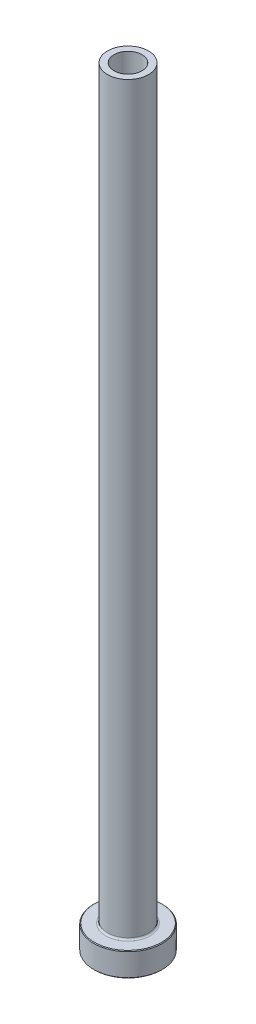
from build123d import *

# Parameters (mm, degrees)
FILLET1_R     = 0.5
CHAMFER1_SIZE = 0.2
CHAMFER3_SIZE = 0.5


with BuildPart() as part:
    # Sketch1 → Revolve1 (revolve)
    with BuildSketch(Plane.XY, mode=Mode.PRIVATE) as revolve1_sk:
        Polygon((-4.1, 225), (-6, 225), (-6, 7), (-10, 7), (-10, 0), (-4.35, 0), (-4.35, 168), (-4.1, 180), align=None)
    revolve(revolve1_sk.sketch.rotate(Axis((0, 92.187680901, 0), (0, -1, 0)), 270), axis=Axis((0, 92.187680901, 0), (0, -1, 0)))

    # Fillet1
    fillet1_edges = [part.edges().sort_by_distance(p)[0] for p in [
        (0, 7, -6),
    ]]
    fillet(fillet1_edges, radius=FILLET1_R)

    # Chamfer1
    chamfer1_edges = [part.edges().sort_by_distance(p)[0] for p in [
        (0, 0, -10),
        (0, 7, -10),
    ]]
    chamfer(chamfer1_edges, length=CHAMFER1_SIZE)

    # Chamfer3
    chamfer3_edges = [part.edges().sort_by_distance(p)[0] for p in [
        (0, 0, -4.35),
    ]]
    chamfer(chamfer3_edges, length=CHAMFER3_SIZE)


solid = part.part
